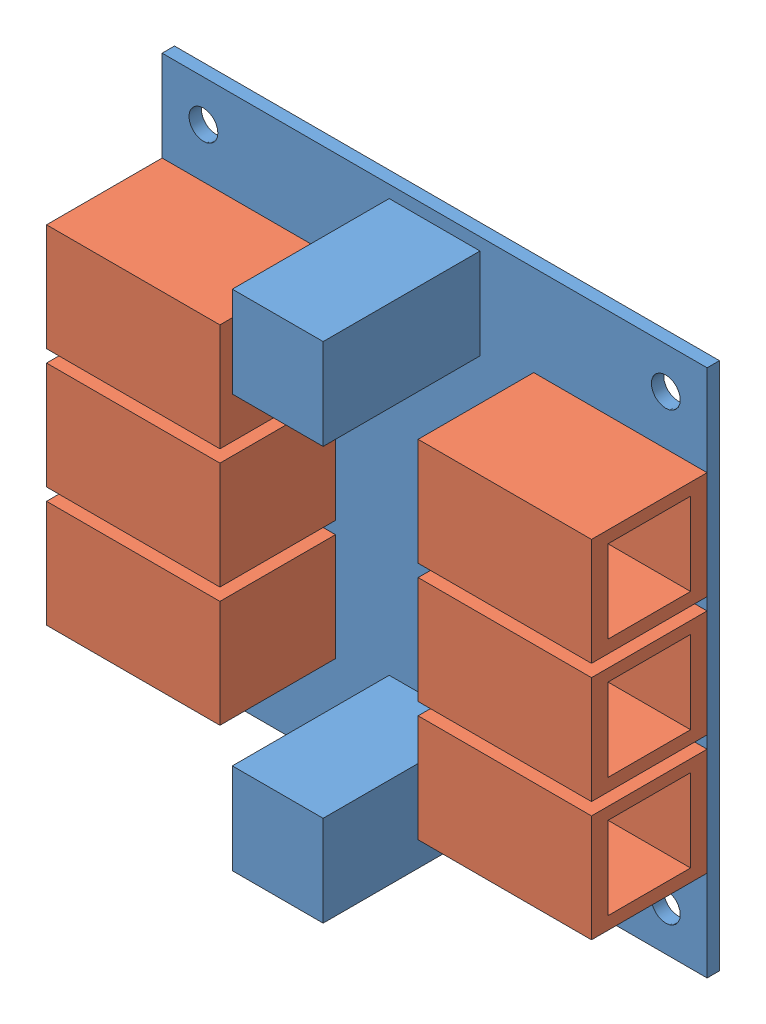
SolidWorks assembly 8 Pin Header Board.SLDASM, configuration Default (file format 13000). Lengths in mm.
Overall size (66 64 20.5).
7 component instances, 2 part files, 3 mates.
Components (placement in the parent):
- 8 pin board-1: 8 pin board.SLDPRT [Default] at origin size (66 64 20.5)
- 8 pin header-1: 8 pin header.SLDPRT [Default] at (-22.5 14.5 1.5) x (-1 0 0) z (0 0 1) size (21 13 14)
- 8 pin header-4: 8 pin header.SLDPRT [Default] at (-22.5 0 1.5) x (-1 0 0) z (0 0 1) size (21 13 14)
- 8 pin header-5: 8 pin header.SLDPRT [Default] at (-22.5 -14.5 1.5) x (-1 0 0) z (0 0 1) size (21 13 14)
- 8 pin header-6: 8 pin header.SLDPRT [Default] at (22.5 14.5 15.5) x (1 0 0) z (0 0 -1) size (21 13 14)
- 8 pin header-7: 8 pin header.SLDPRT [Default] at (22.5 -14.5 15.5) x (1 0 0) z (0 0 -1) size (21 13 14)
- 8 pin header-8: 8 pin header.SLDPRT [Default] at (22.5 0 15.5) x (1 0 0) z (0 0 -1) size (21 13 14)
Mates (geometry in assembly coordinates):
- Coincident1: coincident aligned: plane of 8 pin board-1 through (-33 32 1.5) normal (-1 0 0); plane of 8 pin header-1 through (-33 8 15.5) normal (-1 0 0)
- Coincident2: coincident anti-aligned: plane of 8 pin board-1 through (0 0 1.5) normal (0 0 1); plane of 8 pin header-1 through (-22.5 14.5 1.5) normal (0 0 -1)
- Distance1: distance = 11 mm aligned: plane of 8 pin board-1 through (-33 32 1.5) normal (0 1 0); plane of 8 pin header-1 through (-12 21 15.5) normal (0 1 0)
